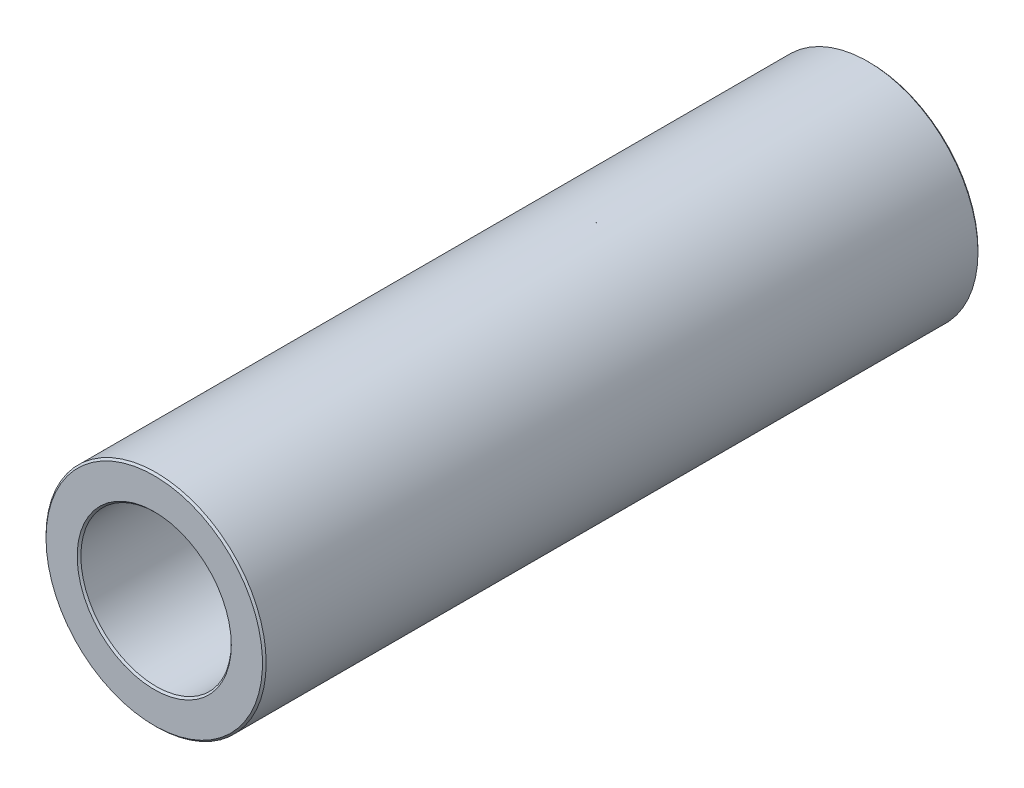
ISO-10303-21;
HEADER;
FILE_DESCRIPTION(('STEP AP214'),'2;1');
FILE_NAME('part.step','',(''),(''),'','','');
FILE_SCHEMA(('AUTOMOTIVE_DESIGN { 1 0 10303 214 1 1 1 1 }'));
ENDSEC;
DATA;
#1=APPLICATION_CONTEXT('core data for automotive mechanical design processes');
#2=APPLICATION_PROTOCOL_DEFINITION('international standard','automotive_design',2000,#1);
#3=PRODUCT_CONTEXT('',#1,'mechanical');
#4=PRODUCT('Part','Part','',(#3));
#5=PRODUCT_RELATED_PRODUCT_CATEGORY('part','',(#4));
#6=PRODUCT_DEFINITION_FORMATION('','',#4);
#7=PRODUCT_DEFINITION_CONTEXT('part definition',#1,'design');
#8=PRODUCT_DEFINITION('design','',#6,#7);
#9=PRODUCT_DEFINITION_SHAPE('','',#8);
#10=(LENGTH_UNIT() NAMED_UNIT(*) SI_UNIT(.MILLI.,.METRE.));
#11=(NAMED_UNIT(*) PLANE_ANGLE_UNIT() SI_UNIT($,.RADIAN.));
#12=(NAMED_UNIT(*) SI_UNIT($,.STERADIAN.) SOLID_ANGLE_UNIT());
#13=UNCERTAINTY_MEASURE_WITH_UNIT(LENGTH_MEASURE(1.E-05),#10,'distance_accuracy_value','');
#14=(GEOMETRIC_REPRESENTATION_CONTEXT(3) GLOBAL_UNCERTAINTY_ASSIGNED_CONTEXT((#13)) GLOBAL_UNIT_ASSIGNED_CONTEXT((#10,
#11,#12)) REPRESENTATION_CONTEXT('',''));
#15=CARTESIAN_POINT('',(0.,0.,0.));
#16=DIRECTION('',(0.,0.,1.));
#17=DIRECTION('',(1.,0.,0.));
#18=AXIS2_PLACEMENT_3D('',#15,#16,#17);
#19=CARTESIAN_POINT('',(0.,0.,0.));
#20=DIRECTION('',(0.,0.,1.));
#21=DIRECTION('',(1.,0.,0.));
#22=AXIS2_PLACEMENT_3D('',#19,#20,#21);
#23=CYLINDRICAL_SURFACE('',#22,4.1);
#24=CARTESIAN_POINT('',(0.,0.,0.0999999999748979));
#25=DIRECTION('',(0.,0.,-1.));
#26=DIRECTION('',(-1.,0.,0.));
#27=AXIS2_PLACEMENT_3D('',#24,#25,#26);
#28=CIRCLE('',#27,4.099999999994);
#29=CARTESIAN_POINT('',(-4.099999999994,0.,0.0999999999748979));
#30=VERTEX_POINT('',#29);
#31=EDGE_CURVE('E34',#30,#30,#28,.T.);
#32=ORIENTED_EDGE('',*,*,#31,.T.);
#33=EDGE_LOOP('',(#32));
#34=FACE_BOUND('',#33,.T.);
#35=CARTESIAN_POINT('',(0.,0.,38.8999999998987));
#36=DIRECTION('',(0.,0.,1.));
#37=DIRECTION('',(-1.,0.,0.));
#38=AXIS2_PLACEMENT_3D('',#35,#36,#37);
#39=CIRCLE('',#38,4.099999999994);
#40=CARTESIAN_POINT('',(-4.099999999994,0.,38.8999999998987));
#41=VERTEX_POINT('',#40);
#42=EDGE_CURVE('E37',#41,#41,#39,.T.);
#43=ORIENTED_EDGE('',*,*,#42,.T.);
#44=EDGE_LOOP('',(#43));
#45=FACE_BOUND('',#44,.T.);
#46=ADVANCED_FACE('F15',(#34,#45),#23,.F.);
#47=CARTESIAN_POINT('',(0.,0.,39.0000000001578));
#48=DIRECTION('',(0.,0.,1.));
#49=DIRECTION('',(1.,0.,0.));
#50=AXIS2_PLACEMENT_3D('',#47,#48,#49);
#51=CONICAL_SURFACE('',#50,4.20000000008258,0.785398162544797);
#52=CARTESIAN_POINT('',(0.,0.,39.000000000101));
#53=DIRECTION('',(0.,0.,1.));
#54=DIRECTION('',(1.,0.,0.));
#55=AXIS2_PLACEMENT_3D('',#52,#53,#54);
#56=CIRCLE('',#55,4.20000000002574);
#57=CARTESIAN_POINT('',(4.20000000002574,0.,39.000000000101));
#58=VERTEX_POINT('',#57);
#59=EDGE_CURVE('E18',#58,#58,#56,.T.);
#60=ORIENTED_EDGE('',*,*,#59,.T.);
#61=EDGE_LOOP('',(#60));
#62=FACE_BOUND('',#61,.T.);
#63=ORIENTED_EDGE('',*,*,#42,.F.);
#64=EDGE_LOOP('',(#63));
#65=FACE_BOUND('',#64,.T.);
#66=ADVANCED_FACE('F55',(#62,#65),#51,.F.);
#67=CARTESIAN_POINT('',(0.,0.,-1.13686837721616E-10));
#68=DIRECTION('',(0.,0.,-1.));
#69=DIRECTION('',(-1.,0.,0.));
#70=AXIS2_PLACEMENT_3D('',#67,#68,#69);
#71=CONICAL_SURFACE('',#70,4.1999999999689,0.785398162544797);
#72=CARTESIAN_POINT('',(0.,0.,-1.13686837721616E-10));
#73=DIRECTION('',(0.,0.,-1.));
#74=DIRECTION('',(-1.,0.,0.));
#75=AXIS2_PLACEMENT_3D('',#72,#73,#74);
#76=CIRCLE('',#75,4.1999999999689);
#77=CARTESIAN_POINT('',(-4.1999999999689,0.,-1.13686837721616E-10));
#78=VERTEX_POINT('',#77);
#79=EDGE_CURVE('E48',#78,#78,#76,.F.);
#80=ORIENTED_EDGE('',*,*,#79,.F.);
#81=EDGE_LOOP('',(#80));
#82=FACE_BOUND('',#81,.T.);
#83=ORIENTED_EDGE('',*,*,#31,.F.);
#84=EDGE_LOOP('',(#83));
#85=FACE_BOUND('',#84,.T.);
#86=ADVANCED_FACE('F62',(#82,#85),#71,.F.);
#87=CARTESIAN_POINT('',(0.,0.,39.));
#88=DIRECTION('',(0.,0.,-1.));
#89=DIRECTION('',(-1.,0.,0.));
#90=AXIS2_PLACEMENT_3D('',#87,#88,#89);
#91=PLANE('',#90);
#92=ORIENTED_EDGE('',*,*,#59,.F.);
#93=EDGE_LOOP('',(#92));
#94=FACE_BOUND('',#93,.T.);
#95=CARTESIAN_POINT('',(0.,0.,39.0000000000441));
#96=DIRECTION('',(0.,0.,-1.));
#97=DIRECTION('',(-1.,0.,0.));
#98=AXIS2_PLACEMENT_3D('',#95,#96,#97);
#99=CIRCLE('',#98,5.89999999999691);
#100=CARTESIAN_POINT('',(-5.89999999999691,0.,39.0000000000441));
#101=VERTEX_POINT('',#100);
#102=EDGE_CURVE('E46',#101,#101,#99,.T.);
#103=ORIENTED_EDGE('',*,*,#102,.F.);
#104=EDGE_LOOP('',(#103));
#105=FACE_BOUND('',#104,.T.);
#106=ADVANCED_FACE('F58',(#94,#105),#91,.F.);
#107=CARTESIAN_POINT('',(0.,0.,0.));
#108=DIRECTION('',(0.,0.,-1.));
#109=DIRECTION('',(-1.,0.,0.));
#110=AXIS2_PLACEMENT_3D('',#107,#108,#109);
#111=PLANE('',#110);
#112=ORIENTED_EDGE('',*,*,#79,.T.);
#113=EDGE_LOOP('',(#112));
#114=FACE_BOUND('',#113,.T.);
#115=CARTESIAN_POINT('',(0.,0.,-5.6843418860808E-11));
#116=DIRECTION('',(0.,0.,1.));
#117=DIRECTION('',(1.,0.,0.));
#118=AXIS2_PLACEMENT_3D('',#115,#116,#117);
#119=CIRCLE('',#118,5.90000000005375);
#120=CARTESIAN_POINT('',(5.90000000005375,0.,-5.6843418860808E-11));
#121=VERTEX_POINT('',#120);
#122=EDGE_CURVE('E27',#121,#121,#119,.T.);
#123=ORIENTED_EDGE('',*,*,#122,.F.);
#124=EDGE_LOOP('',(#123));
#125=FACE_BOUND('',#124,.T.);
#126=ADVANCED_FACE('F61',(#114,#125),#111,.T.);
#127=CARTESIAN_POINT('',(0.,0.,38.9000000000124));
#128=DIRECTION('',(0.,0.,-1.));
#129=DIRECTION('',(-1.,0.,0.));
#130=AXIS2_PLACEMENT_3D('',#127,#128,#129);
#131=CONICAL_SURFACE('',#130,5.99999999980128,0.78539816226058);
#132=CARTESIAN_POINT('',(0.,0.,38.9));
#133=DIRECTION('',(0.,0.,1.));
#134=DIRECTION('',(1.,0.,0.));
#135=AXIS2_PLACEMENT_3D('',#132,#133,#134);
#136=CIRCLE('',#135,6.);
#137=CARTESIAN_POINT('',(6.,0.,38.9));
#138=VERTEX_POINT('',#137);
#139=EDGE_CURVE('E22',#138,#138,#136,.F.);
#140=ORIENTED_EDGE('',*,*,#139,.F.);
#141=EDGE_LOOP('',(#140));
#142=FACE_BOUND('',#141,.T.);
#143=ORIENTED_EDGE('',*,*,#102,.T.);
#144=EDGE_LOOP('',(#143));
#145=FACE_BOUND('',#144,.T.);
#146=ADVANCED_FACE('F66',(#142,#145),#131,.T.);
#147=CARTESIAN_POINT('',(0.,0.,0.100000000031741));
#148=DIRECTION('',(0.,0.,1.));
#149=DIRECTION('',(1.,0.,0.));
#150=AXIS2_PLACEMENT_3D('',#147,#148,#149);
#151=CONICAL_SURFACE('',#150,5.99999999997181,0.785398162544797);
#152=ORIENTED_EDGE('',*,*,#122,.T.);
#153=EDGE_LOOP('',(#152));
#154=FACE_BOUND('',#153,.T.);
#155=CARTESIAN_POINT('',(0.,0.,0.1));
#156=DIRECTION('',(0.,0.,1.));
#157=DIRECTION('',(1.,0.,0.));
#158=AXIS2_PLACEMENT_3D('',#155,#156,#157);
#159=CIRCLE('',#158,6.);
#160=CARTESIAN_POINT('',(6.,0.,0.1));
#161=VERTEX_POINT('',#160);
#162=EDGE_CURVE('E10',#161,#161,#159,.T.);
#163=ORIENTED_EDGE('',*,*,#162,.F.);
#164=EDGE_LOOP('',(#163));
#165=FACE_BOUND('',#164,.T.);
#166=ADVANCED_FACE('F68',(#154,#165),#151,.T.);
#167=CARTESIAN_POINT('',(0.,0.,0.));
#168=DIRECTION('',(0.,0.,1.));
#169=DIRECTION('',(1.,0.,0.));
#170=AXIS2_PLACEMENT_3D('',#167,#168,#169);
#171=CYLINDRICAL_SURFACE('',#170,6.);
#172=ORIENTED_EDGE('',*,*,#162,.T.);
#173=EDGE_LOOP('',(#172));
#174=FACE_BOUND('',#173,.T.);
#175=ORIENTED_EDGE('',*,*,#139,.T.);
#176=EDGE_LOOP('',(#175));
#177=FACE_BOUND('',#176,.T.);
#178=ADVANCED_FACE('F76',(#174,#177),#171,.T.);
#179=CLOSED_SHELL('',(#46,#66,#86,#106,#126,#146,#166,#178));
#180=MANIFOLD_SOLID_BREP('B1',#179);
#181=ADVANCED_BREP_SHAPE_REPRESENTATION('',(#18,#180),#14);
#182=SHAPE_DEFINITION_REPRESENTATION(#9,#181);
ENDSEC;
END-ISO-10303-21;
